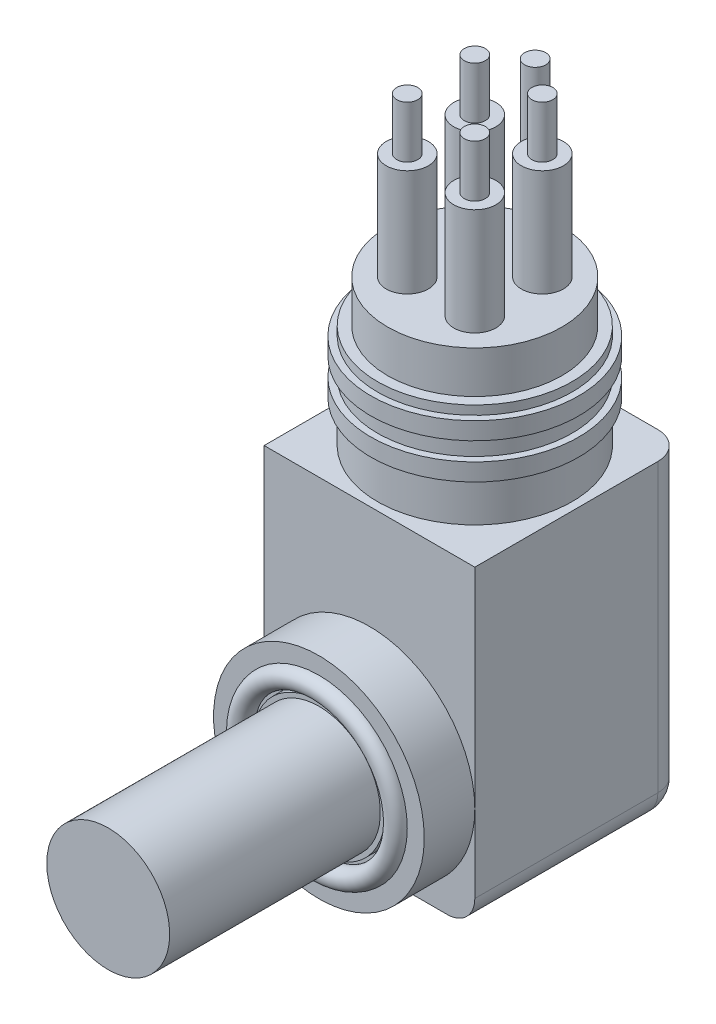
from build123d import *

# Parameters (mm, degrees)
SKETCH1_W          = 19.05
SKETCH1_H          = 19.05
EXTRUDE1_DEPTH     = 28.448
SKETCH3_R          = 7.874
EXTRUDE2_DEPTH     = 3.81
SKETCH4_R          = 1.905
EXTRUDE3_DEPTH     = 9.652
SKETCH5_R          = 0.9525
EXTRUDE4_DEPTH     = 4.699
CIRPATTERN1_COUNT  = 4
SKETCH_1_R         = 0.9525
EXTRUDE5_DEPTH     = 14.351
SKETCH10_R         = 9.525
EXTRUDE8_DEPTH     = 4.572
SKETCH11_R         = 7.9885
SKETCH11_R_2       = 5.9565
CUT_EXTRUDE1_DEPTH = 1.27
SKETCH8_R          = 5.55625
EXTRUDE7_DEPTH     = 19.05
SKETCH9_R          = 0.89
FILLET1_R          = 2.5


with BuildPart() as part:
    # Sketch1 → Extrude1 (new body)
    with BuildSketch(Plane(origin=(0, 0, 0), x_dir=(1, 0, 0), z_dir=(0, 1, 0))):
        Rectangle(SKETCH1_W, SKETCH1_H)
    extrude(amount=EXTRUDE1_DEPTH)

    # Sketch2 → Revolve1 (revolve)
    with BuildSketch(Plane.XY, mode=Mode.PRIVATE) as revolve1_sk:
        Polygon((8.8011, 28.448), (8.8011, 32.2326), (9.398, 32.2326), (9.398, 33.8074), (8.8011, 33.8074), (8.8011, 35.4584), (9.398, 35.4584), (9.398, 37.0332), (8.8011, 37.0332), (8.8011, 37.846), (0, 37.846), (0, 28.448), align=None)
    revolve(revolve1_sk.sketch.rotate(Axis((0, 0, 0), (0, -1, 0)), 180), axis=Axis((0, 0, 0), (0, -1, 0)))

    # Sketch3 → Extrude2 (add)
    with BuildSketch(Plane(origin=(0, 37.846, 0), x_dir=(-1, 0, 0), z_dir=(0, 1, 0))):
        with Locations(Location((0, 0, 0), (0, 0, 180))):
            Circle(SKETCH3_R)
    extrude(amount=EXTRUDE2_DEPTH)

    # Sketch4 → Extrude3 (add)
    with BuildSketch(Plane(origin=(0, 41.656, 0), x_dir=(-1, 0, 0), z_dir=(0, 1, 0))):
        with Locations((3.053287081, 3.053287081)):
            Circle(SKETCH4_R)
    extrude3 = extrude(amount=EXTRUDE3_DEPTH)

    # Sketch5 → Extrude4 (add)
    with BuildSketch(Plane(origin=(0, 51.308, 0), x_dir=(-1, 0, 0), z_dir=(0, 1, 0))):
        with Locations((3.053287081, 3.053287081)):
            Circle(SKETCH5_R)
    extrude4 = extrude(amount=EXTRUDE4_DEPTH)

    # CirPattern1: Extrude3, Extrude4 ×4 about axis
    cirpattern1_axis = Axis((0, 0, 0), (0, 1, 0))
    add([extrude3.rotate(cirpattern1_axis, i * 360 / CIRPATTERN1_COUNT) for i in range(1, CIRPATTERN1_COUNT)])
    add([extrude4.rotate(cirpattern1_axis, i * 360 / CIRPATTERN1_COUNT) for i in range(1, CIRPATTERN1_COUNT)])

    # Sketch 1 → Extrude5 (add)
    with BuildSketch(Plane(origin=(0.09953018, 41.656, 4.480198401), x_dir=(-1, 0, 0), z_dir=(0, 1, 0))):
        with Locations((0.09953018, -9.938400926)):
            Circle(SKETCH_1_R)
    extrude(amount=EXTRUDE5_DEPTH)

    # Sketch10 → Extrude8 (add)
    with BuildSketch(Plane.XY.offset(9.525)):
        with Locations((0, 9.525)):
            Circle(SKETCH10_R)
    extrude(amount=EXTRUDE8_DEPTH)

    # Sketch11 → Cut-Extrude1 (cut)
    with BuildSketch(Plane.XY.offset(14.097)):
        with Locations((0, 9.525)):
            Circle(SKETCH11_R)
        with Locations((0, 9.525)):
            Circle(SKETCH11_R_2, mode=Mode.SUBTRACT)
    extrude(amount=-CUT_EXTRUDE1_DEPTH, mode=Mode.SUBTRACT)

    # Sketch8 → Extrude7 (add)
    with BuildSketch(Plane(origin=(0, 12.8, 14.097), x_dir=(1, 0, 0), z_dir=(0, 0, -1))):
        with Locations(Location((0, 3.275, 0), (0, 0, 180))):
            Circle(SKETCH8_R)
    extrude(amount=-EXTRUDE7_DEPTH)

    # Sketch9 → o-ring 12.42x1.78 (revolve)
    with BuildSketch(Plane(origin=(0, -0.125998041, 0.125998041), x_dir=(0, 1, 0), z_dir=(1, 0, 0)), mode=Mode.PRIVATE) as o_ring_12_42x1_78_sk:
        with Locations((16.750998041, 13.971001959)):
            Circle(SKETCH9_R)
    revolve(o_ring_12_42x1_78_sk.sketch.rotate(Axis((0, 9.525, 13.263482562), (0, 0, -1)), 90), axis=Axis((0, 9.525, 13.263482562), (0, 0, -1)))

    # Fillet1
    fillet1_edges = [part.edges().sort_by_distance(p)[0] for p in [
        (0, 0, -9.525),
        (9.525, 0, 0),
        (-9.525, 0, 0),
        (-9.525, 14.224, -9.525),
        (9.525, 14.224, -9.525),
    ]]
    fillet(fillet1_edges, radius=FILLET1_R)


solid = part.part
